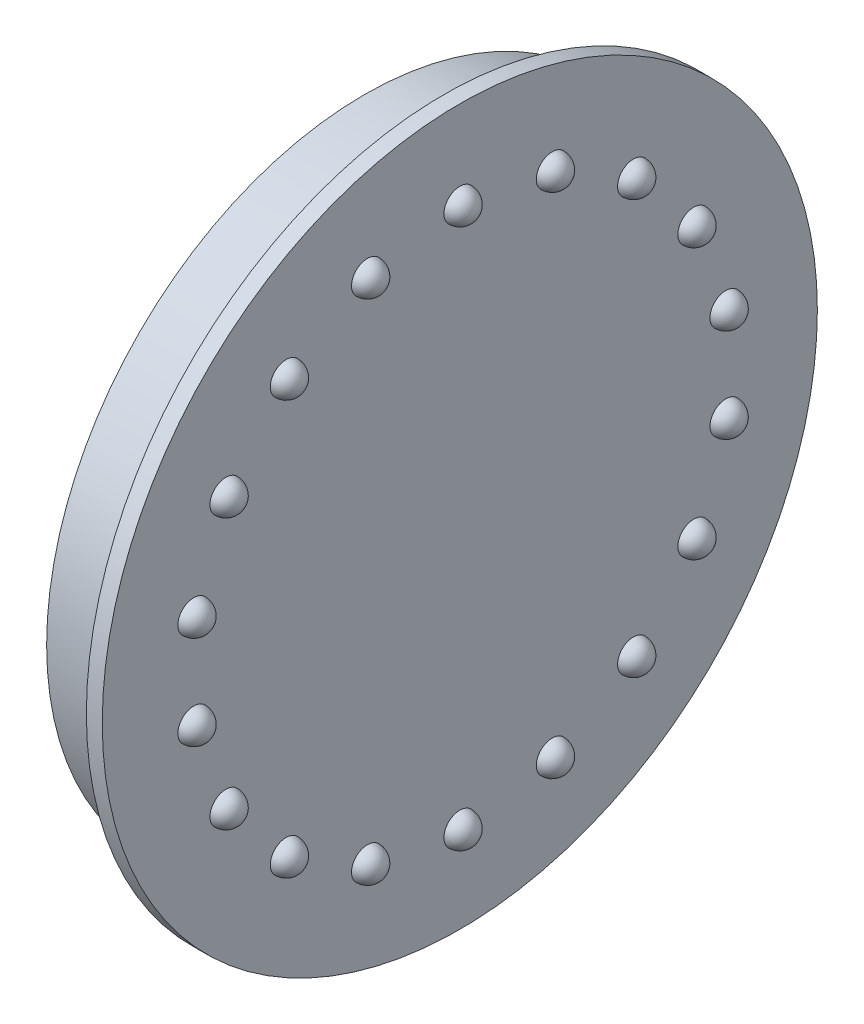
ISO-10303-21;
HEADER;
FILE_DESCRIPTION(('STEP AP214'),'2;1');
FILE_NAME('part.step','',(''),(''),'','','');
FILE_SCHEMA(('AUTOMOTIVE_DESIGN { 1 0 10303 214 1 1 1 1 }'));
ENDSEC;
DATA;
#1=APPLICATION_CONTEXT('core data for automotive mechanical design processes');
#2=APPLICATION_PROTOCOL_DEFINITION('international standard','automotive_design',2000,#1);
#3=PRODUCT_CONTEXT('',#1,'mechanical');
#4=PRODUCT('Part','Part','',(#3));
#5=PRODUCT_RELATED_PRODUCT_CATEGORY('part','',(#4));
#6=PRODUCT_DEFINITION_FORMATION('','',#4);
#7=PRODUCT_DEFINITION_CONTEXT('part definition',#1,'design');
#8=PRODUCT_DEFINITION('design','',#6,#7);
#9=PRODUCT_DEFINITION_SHAPE('','',#8);
#10=(LENGTH_UNIT() NAMED_UNIT(*) SI_UNIT(.MILLI.,.METRE.));
#11=(NAMED_UNIT(*) PLANE_ANGLE_UNIT() SI_UNIT($,.RADIAN.));
#12=(NAMED_UNIT(*) SI_UNIT($,.STERADIAN.) SOLID_ANGLE_UNIT());
#13=UNCERTAINTY_MEASURE_WITH_UNIT(LENGTH_MEASURE(1.E-05),#10,'distance_accuracy_value','');
#14=(GEOMETRIC_REPRESENTATION_CONTEXT(3) GLOBAL_UNCERTAINTY_ASSIGNED_CONTEXT((#13)) GLOBAL_UNIT_ASSIGNED_CONTEXT((#10,
#11,#12)) REPRESENTATION_CONTEXT('',''));
#15=CARTESIAN_POINT('',(0.,0.,0.));
#16=DIRECTION('',(0.,0.,1.));
#17=DIRECTION('',(1.,0.,0.));
#18=AXIS2_PLACEMENT_3D('',#15,#16,#17);
#19=CARTESIAN_POINT('',(6.,0.,0.));
#20=DIRECTION('',(1.,0.,0.));
#21=DIRECTION('',(0.,0.,-1.));
#22=AXIS2_PLACEMENT_3D('',#19,#20,#21);
#23=PLANE('',#22);
#24=CARTESIAN_POINT('',(6.,-13.0227555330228,-10.927389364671));
#25=DIRECTION('',(1.,0.,0.));
#26=DIRECTION('',(0.,0.,-1.));
#27=AXIS2_PLACEMENT_3D('',#24,#25,#26);
#28=CIRCLE('',#27,1.);
#29=CARTESIAN_POINT('',(6.,-13.0227555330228,-11.927389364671));
#30=VERTEX_POINT('',#29);
#31=EDGE_CURVE('E98',#30,#30,#28,.T.);
#32=ORIENTED_EDGE('',*,*,#31,.F.);
#33=EDGE_LOOP('',(#32));
#34=FACE_BOUND('',#33,.T.);
#35=CARTESIAN_POINT('',(6.,-2.95201902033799,-16.7417318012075));
#36=DIRECTION('',(1.,0.,0.));
#37=DIRECTION('',(0.,0.,-1.));
#38=AXIS2_PLACEMENT_3D('',#35,#36,#37);
#39=CIRCLE('',#38,1.);
#40=CARTESIAN_POINT('',(6.,-2.95201902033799,-17.7417318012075));
#41=VERTEX_POINT('',#40);
#42=EDGE_CURVE('E92',#41,#41,#39,.T.);
#43=ORIENTED_EDGE('',*,*,#42,.F.);
#44=EDGE_LOOP('',(#43));
#45=FACE_BOUND('',#44,.T.);
#46=CARTESIAN_POINT('',(6.,8.49999999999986,-14.7224318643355));
#47=DIRECTION('',(1.,0.,0.));
#48=DIRECTION('',(0.,0.,-1.));
#49=AXIS2_PLACEMENT_3D('',#46,#47,#48);
#50=CIRCLE('',#49,0.999999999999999);
#51=CARTESIAN_POINT('',(6.,8.49999999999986,-15.7224318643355));
#52=VERTEX_POINT('',#51);
#53=EDGE_CURVE('E86',#52,#52,#50,.T.);
#54=ORIENTED_EDGE('',*,*,#53,.F.);
#55=EDGE_LOOP('',(#54));
#56=FACE_BOUND('',#55,.T.);
#57=CARTESIAN_POINT('',(6.,15.9747745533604,-5.81434243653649));
#58=DIRECTION('',(1.,0.,0.));
#59=DIRECTION('',(0.,0.,-1.));
#60=AXIS2_PLACEMENT_3D('',#57,#58,#59);
#61=CIRCLE('',#60,1.);
#62=CARTESIAN_POINT('',(6.,15.9747745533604,-6.81434243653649));
#63=VERTEX_POINT('',#62);
#64=EDGE_CURVE('E80',#63,#63,#61,.T.);
#65=ORIENTED_EDGE('',*,*,#64,.F.);
#66=EDGE_LOOP('',(#65));
#67=FACE_BOUND('',#66,.T.);
#68=CARTESIAN_POINT('',(6.,15.9747745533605,5.81434243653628));
#69=DIRECTION('',(1.,0.,0.));
#70=DIRECTION('',(0.,0.,-1.));
#71=AXIS2_PLACEMENT_3D('',#68,#69,#70);
#72=CIRCLE('',#71,1.);
#73=CARTESIAN_POINT('',(6.,15.9747745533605,4.81434243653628));
#74=VERTEX_POINT('',#73);
#75=EDGE_CURVE('E74',#74,#74,#72,.T.);
#76=ORIENTED_EDGE('',*,*,#75,.F.);
#77=EDGE_LOOP('',(#76));
#78=FACE_BOUND('',#77,.T.);
#79=CARTESIAN_POINT('',(6.,8.50000000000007,14.7224318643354));
#80=DIRECTION('',(1.,0.,0.));
#81=DIRECTION('',(0.,0.,-1.));
#82=AXIS2_PLACEMENT_3D('',#79,#80,#81);
#83=CIRCLE('',#82,0.999999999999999);
#84=CARTESIAN_POINT('',(6.,8.50000000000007,13.7224318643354));
#85=VERTEX_POINT('',#84);
#86=EDGE_CURVE('E68',#85,#85,#83,.T.);
#87=ORIENTED_EDGE('',*,*,#86,.F.);
#88=EDGE_LOOP('',(#87));
#89=FACE_BOUND('',#88,.T.);
#90=CARTESIAN_POINT('',(6.,-2.95201902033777,16.7417318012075));
#91=DIRECTION('',(1.,0.,0.));
#92=DIRECTION('',(0.,0.,-1.));
#93=AXIS2_PLACEMENT_3D('',#90,#91,#92);
#94=CIRCLE('',#93,0.999999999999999);
#95=CARTESIAN_POINT('',(6.,-2.95201902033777,15.7417318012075));
#96=VERTEX_POINT('',#95);
#97=EDGE_CURVE('E62',#96,#96,#94,.T.);
#98=ORIENTED_EDGE('',*,*,#97,.F.);
#99=EDGE_LOOP('',(#98));
#100=FACE_BOUND('',#99,.T.);
#101=CARTESIAN_POINT('',(6.,-13.0227555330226,10.9273893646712));
#102=DIRECTION('',(1.,0.,0.));
#103=DIRECTION('',(0.,0.,-1.));
#104=AXIS2_PLACEMENT_3D('',#101,#102,#103);
#105=CIRCLE('',#104,0.999999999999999);
#106=CARTESIAN_POINT('',(6.,-13.0227555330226,9.92738936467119));
#107=VERTEX_POINT('',#106);
#108=EDGE_CURVE('E56',#107,#107,#105,.T.);
#109=ORIENTED_EDGE('',*,*,#108,.F.);
#110=EDGE_LOOP('',(#109));
#111=FACE_BOUND('',#110,.T.);
#112=CARTESIAN_POINT('',(6.,-17.,0.));
#113=DIRECTION('',(1.,0.,0.));
#114=DIRECTION('',(0.,0.,-1.));
#115=AXIS2_PLACEMENT_3D('',#112,#113,#114);
#116=CIRCLE('',#115,1.);
#117=CARTESIAN_POINT('',(6.,-17.,-1.));
#118=VERTEX_POINT('',#117);
#119=EDGE_CURVE('E50',#118,#118,#116,.T.);
#120=ORIENTED_EDGE('',*,*,#119,.F.);
#121=EDGE_LOOP('',(#120));
#122=FACE_BOUND('',#121,.T.);
#123=CARTESIAN_POINT('',(6.,0.,0.));
#124=DIRECTION('',(1.,0.,0.));
#125=DIRECTION('',(0.,0.,-1.));
#126=AXIS2_PLACEMENT_3D('',#123,#124,#125);
#127=CIRCLE('',#126,22.5);
#128=CARTESIAN_POINT('',(6.,0.,-22.5));
#129=VERTEX_POINT('',#128);
#130=EDGE_CURVE('E41',#129,#129,#127,.T.);
#131=ORIENTED_EDGE('',*,*,#130,.T.);
#132=EDGE_LOOP('',(#131));
#133=FACE_BOUND('',#132,.T.);
#134=CARTESIAN_POINT('',(6.,-15.9747745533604,5.81434243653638));
#135=DIRECTION('',(1.,0.,0.));
#136=DIRECTION('',(0.,0.,-1.));
#137=AXIS2_PLACEMENT_3D('',#134,#135,#136);
#138=CIRCLE('',#137,1.);
#139=CARTESIAN_POINT('',(6.,-15.9747745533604,4.81434243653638));
#140=VERTEX_POINT('',#139);
#141=EDGE_CURVE('E53',#140,#140,#138,.T.);
#142=ORIENTED_EDGE('',*,*,#141,.F.);
#143=EDGE_LOOP('',(#142));
#144=FACE_BOUND('',#143,.T.);
#145=CARTESIAN_POINT('',(6.,-8.49999999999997,14.7224318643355));
#146=DIRECTION('',(1.,0.,0.));
#147=DIRECTION('',(0.,0.,-1.));
#148=AXIS2_PLACEMENT_3D('',#145,#146,#147);
#149=CIRCLE('',#148,1.);
#150=CARTESIAN_POINT('',(6.,-8.49999999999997,13.7224318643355));
#151=VERTEX_POINT('',#150);
#152=EDGE_CURVE('E59',#151,#151,#149,.T.);
#153=ORIENTED_EDGE('',*,*,#152,.F.);
#154=EDGE_LOOP('',(#153));
#155=FACE_BOUND('',#154,.T.);
#156=CARTESIAN_POINT('',(6.,2.95201902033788,16.7417318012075));
#157=DIRECTION('',(1.,0.,0.));
#158=DIRECTION('',(0.,0.,-1.));
#159=AXIS2_PLACEMENT_3D('',#156,#157,#158);
#160=CIRCLE('',#159,1.);
#161=CARTESIAN_POINT('',(6.,2.95201902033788,15.7417318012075));
#162=VERTEX_POINT('',#161);
#163=EDGE_CURVE('E65',#162,#162,#160,.T.);
#164=ORIENTED_EDGE('',*,*,#163,.F.);
#165=EDGE_LOOP('',(#164));
#166=FACE_BOUND('',#165,.T.);
#167=CARTESIAN_POINT('',(6.,13.0227555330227,10.9273893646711));
#168=DIRECTION('',(1.,0.,0.));
#169=DIRECTION('',(0.,0.,-1.));
#170=AXIS2_PLACEMENT_3D('',#167,#168,#169);
#171=CIRCLE('',#170,1.);
#172=CARTESIAN_POINT('',(6.,13.0227555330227,9.9273893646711));
#173=VERTEX_POINT('',#172);
#174=EDGE_CURVE('E71',#173,#173,#171,.T.);
#175=ORIENTED_EDGE('',*,*,#174,.F.);
#176=EDGE_LOOP('',(#175));
#177=FACE_BOUND('',#176,.T.);
#178=CARTESIAN_POINT('',(6.,17.,-1.18710434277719E-13));
#179=DIRECTION('',(1.,0.,0.));
#180=DIRECTION('',(0.,0.,-1.));
#181=AXIS2_PLACEMENT_3D('',#178,#179,#180);
#182=CIRCLE('',#181,1.);
#183=CARTESIAN_POINT('',(6.,17.,-1.00000000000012));
#184=VERTEX_POINT('',#183);
#185=EDGE_CURVE('E77',#184,#184,#182,.T.);
#186=ORIENTED_EDGE('',*,*,#185,.F.);
#187=EDGE_LOOP('',(#186));
#188=FACE_BOUND('',#187,.T.);
#189=CARTESIAN_POINT('',(6.,13.0227555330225,-10.9273893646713));
#190=DIRECTION('',(1.,0.,0.));
#191=DIRECTION('',(0.,0.,-1.));
#192=AXIS2_PLACEMENT_3D('',#189,#190,#191);
#193=CIRCLE('',#192,1.);
#194=CARTESIAN_POINT('',(6.,13.0227555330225,-11.9273893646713));
#195=VERTEX_POINT('',#194);
#196=EDGE_CURVE('E83',#195,#195,#193,.T.);
#197=ORIENTED_EDGE('',*,*,#196,.F.);
#198=EDGE_LOOP('',(#197));
#199=FACE_BOUND('',#198,.T.);
#200=CARTESIAN_POINT('',(6.,2.95201902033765,-16.7417318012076));
#201=DIRECTION('',(1.,0.,0.));
#202=DIRECTION('',(0.,0.,-1.));
#203=AXIS2_PLACEMENT_3D('',#200,#201,#202);
#204=CIRCLE('',#203,1.);
#205=CARTESIAN_POINT('',(6.,2.95201902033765,-17.7417318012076));
#206=VERTEX_POINT('',#205);
#207=EDGE_CURVE('E89',#206,#206,#204,.T.);
#208=ORIENTED_EDGE('',*,*,#207,.F.);
#209=EDGE_LOOP('',(#208));
#210=FACE_BOUND('',#209,.T.);
#211=CARTESIAN_POINT('',(6.,-8.50000000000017,-14.7224318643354));
#212=DIRECTION('',(1.,0.,0.));
#213=DIRECTION('',(0.,0.,-1.));
#214=AXIS2_PLACEMENT_3D('',#211,#212,#213);
#215=CIRCLE('',#214,1.);
#216=CARTESIAN_POINT('',(6.,-8.50000000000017,-15.7224318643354));
#217=VERTEX_POINT('',#216);
#218=EDGE_CURVE('E95',#217,#217,#215,.T.);
#219=ORIENTED_EDGE('',*,*,#218,.F.);
#220=EDGE_LOOP('',(#219));
#221=FACE_BOUND('',#220,.T.);
#222=CARTESIAN_POINT('',(6.,-15.9747745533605,-5.81434243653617));
#223=DIRECTION('',(1.,0.,0.));
#224=DIRECTION('',(0.,0.,-1.));
#225=AXIS2_PLACEMENT_3D('',#222,#223,#224);
#226=CIRCLE('',#225,1.);
#227=CARTESIAN_POINT('',(6.,-15.9747745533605,-6.81434243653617));
#228=VERTEX_POINT('',#227);
#229=EDGE_CURVE('E101',#228,#228,#226,.T.);
#230=ORIENTED_EDGE('',*,*,#229,.F.);
#231=EDGE_LOOP('',(#230));
#232=FACE_BOUND('',#231,.T.);
#233=ADVANCED_FACE('F30',(#34,#45,#56,#67,#78,#89,#100,#111,#122,#133,#144,#155,#166,#177,#188,
#199,#210,#221,#232),#23,.T.);
#234=CARTESIAN_POINT('',(5.,0.,0.));
#235=DIRECTION('',(-1.,0.,0.));
#236=DIRECTION('',(0.,0.,1.));
#237=AXIS2_PLACEMENT_3D('',#234,#235,#236);
#238=CYLINDRICAL_SURFACE('',#237,20.);
#239=CARTESIAN_POINT('',(5.,0.,0.));
#240=DIRECTION('',(1.,0.,0.));
#241=DIRECTION('',(0.,0.,-1.));
#242=AXIS2_PLACEMENT_3D('',#239,#240,#241);
#243=CIRCLE('',#242,20.);
#244=CARTESIAN_POINT('',(5.,0.,-20.));
#245=VERTEX_POINT('',#244);
#246=EDGE_CURVE('E10',#245,#245,#243,.T.);
#247=ORIENTED_EDGE('',*,*,#246,.F.);
#248=EDGE_LOOP('',(#247));
#249=FACE_BOUND('',#248,.T.);
#250=CARTESIAN_POINT('',(0.,0.,0.));
#251=DIRECTION('',(1.,0.,0.));
#252=DIRECTION('',(0.,0.,-1.));
#253=AXIS2_PLACEMENT_3D('',#250,#251,#252);
#254=CIRCLE('',#253,20.);
#255=CARTESIAN_POINT('',(0.,0.,-20.));
#256=VERTEX_POINT('',#255);
#257=EDGE_CURVE('E37',#256,#256,#254,.T.);
#258=ORIENTED_EDGE('',*,*,#257,.T.);
#259=EDGE_LOOP('',(#258));
#260=FACE_BOUND('',#259,.T.);
#261=ADVANCED_FACE('F32',(#249,#260),#238,.T.);
#262=CARTESIAN_POINT('',(0.,0.,0.));
#263=DIRECTION('',(1.,0.,0.));
#264=DIRECTION('',(0.,0.,-1.));
#265=AXIS2_PLACEMENT_3D('',#262,#263,#264);
#266=PLANE('',#265);
#267=ORIENTED_EDGE('',*,*,#257,.F.);
#268=EDGE_LOOP('',(#267));
#269=FACE_BOUND('',#268,.T.);
#270=ADVANCED_FACE('F113',(#269),#266,.F.);
#271=CARTESIAN_POINT('',(5.,0.,0.));
#272=DIRECTION('',(1.,0.,0.));
#273=DIRECTION('',(0.,0.,-1.));
#274=AXIS2_PLACEMENT_3D('',#271,#272,#273);
#275=PLANE('',#274);
#276=CARTESIAN_POINT('',(5.,0.,0.));
#277=DIRECTION('',(1.,0.,0.));
#278=DIRECTION('',(0.,0.,-1.));
#279=AXIS2_PLACEMENT_3D('',#276,#277,#278);
#280=CIRCLE('',#279,22.5);
#281=CARTESIAN_POINT('',(5.,0.,-22.5));
#282=VERTEX_POINT('',#281);
#283=EDGE_CURVE('E45',#282,#282,#280,.T.);
#284=ORIENTED_EDGE('',*,*,#283,.F.);
#285=EDGE_LOOP('',(#284));
#286=FACE_BOUND('',#285,.T.);
#287=ORIENTED_EDGE('',*,*,#246,.T.);
#288=EDGE_LOOP('',(#287));
#289=FACE_BOUND('',#288,.T.);
#290=ADVANCED_FACE('F119',(#286,#289),#275,.F.);
#291=CARTESIAN_POINT('',(6.,0.,0.));
#292=DIRECTION('',(-1.,0.,0.));
#293=DIRECTION('',(0.,0.,1.));
#294=AXIS2_PLACEMENT_3D('',#291,#292,#293);
#295=CYLINDRICAL_SURFACE('',#294,22.5);
#296=ORIENTED_EDGE('',*,*,#130,.F.);
#297=EDGE_LOOP('',(#296));
#298=FACE_BOUND('',#297,.T.);
#299=ORIENTED_EDGE('',*,*,#283,.T.);
#300=EDGE_LOOP('',(#299));
#301=FACE_BOUND('',#300,.T.);
#302=ADVANCED_FACE('F121',(#298,#301),#295,.T.);
#303=CARTESIAN_POINT('',(6.,15.9747745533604,-5.81434243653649));
#304=DIRECTION('',(0.,0.,1.));
#305=DIRECTION('',(1.,0.,0.));
#306=AXIS2_PLACEMENT_3D('',#303,#304,#305);
#307=SPHERICAL_SURFACE('',#306,1.);
#308=CARTESIAN_POINT('',(6.,15.9747745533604,-5.81434243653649));
#309=DIRECTION('',(1.,0.,0.));
#310=DIRECTION('',(0.,0.,-1.));
#311=AXIS2_PLACEMENT_3D('',#308,#309,#310);
#312=SPHERICAL_SURFACE('',#311,1.);
#313=ORIENTED_EDGE('',*,*,#64,.T.);
#314=EDGE_LOOP('',(#313));
#315=FACE_BOUND('',#314,.T.);
#316=ADVANCED_FACE('F123',(#315),#312,.T.);
#317=CARTESIAN_POINT('',(6.,13.0227555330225,-10.9273893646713));
#318=DIRECTION('',(0.,0.,1.));
#319=DIRECTION('',(1.,0.,0.));
#320=AXIS2_PLACEMENT_3D('',#317,#318,#319);
#321=SPHERICAL_SURFACE('',#320,1.);
#322=CARTESIAN_POINT('',(6.,13.0227555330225,-10.9273893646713));
#323=DIRECTION('',(1.,0.,0.));
#324=DIRECTION('',(0.,0.,-1.));
#325=AXIS2_PLACEMENT_3D('',#322,#323,#324);
#326=SPHERICAL_SURFACE('',#325,1.);
#327=ORIENTED_EDGE('',*,*,#196,.T.);
#328=EDGE_LOOP('',(#327));
#329=FACE_BOUND('',#328,.T.);
#330=ADVANCED_FACE('F145',(#329),#326,.T.);
#331=CARTESIAN_POINT('',(6.,8.49999999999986,-14.7224318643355));
#332=DIRECTION('',(0.,0.,1.));
#333=DIRECTION('',(1.,0.,0.));
#334=AXIS2_PLACEMENT_3D('',#331,#332,#333);
#335=SPHERICAL_SURFACE('',#334,1.);
#336=CARTESIAN_POINT('',(6.,8.49999999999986,-14.7224318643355));
#337=DIRECTION('',(1.,0.,0.));
#338=DIRECTION('',(0.,0.,-1.));
#339=AXIS2_PLACEMENT_3D('',#336,#337,#338);
#340=SPHERICAL_SURFACE('',#339,1.);
#341=ORIENTED_EDGE('',*,*,#53,.T.);
#342=EDGE_LOOP('',(#341));
#343=FACE_BOUND('',#342,.T.);
#344=ADVANCED_FACE('F151',(#343),#340,.T.);
#345=CARTESIAN_POINT('',(6.,2.95201902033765,-16.7417318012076));
#346=DIRECTION('',(0.,0.,1.));
#347=DIRECTION('',(1.,0.,0.));
#348=AXIS2_PLACEMENT_3D('',#345,#346,#347);
#349=SPHERICAL_SURFACE('',#348,1.);
#350=CARTESIAN_POINT('',(6.,2.95201902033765,-16.7417318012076));
#351=DIRECTION('',(1.,0.,0.));
#352=DIRECTION('',(0.,0.,-1.));
#353=AXIS2_PLACEMENT_3D('',#350,#351,#352);
#354=SPHERICAL_SURFACE('',#353,1.);
#355=ORIENTED_EDGE('',*,*,#207,.T.);
#356=EDGE_LOOP('',(#355));
#357=FACE_BOUND('',#356,.T.);
#358=ADVANCED_FACE('F158',(#357),#354,.T.);
#359=CARTESIAN_POINT('',(6.,-2.95201902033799,-16.7417318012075));
#360=DIRECTION('',(0.,0.,1.));
#361=DIRECTION('',(1.,0.,0.));
#362=AXIS2_PLACEMENT_3D('',#359,#360,#361);
#363=SPHERICAL_SURFACE('',#362,1.);
#364=CARTESIAN_POINT('',(6.,-2.95201902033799,-16.7417318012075));
#365=DIRECTION('',(1.,0.,0.));
#366=DIRECTION('',(0.,0.,-1.));
#367=AXIS2_PLACEMENT_3D('',#364,#365,#366);
#368=SPHERICAL_SURFACE('',#367,1.);
#369=ORIENTED_EDGE('',*,*,#42,.T.);
#370=EDGE_LOOP('',(#369));
#371=FACE_BOUND('',#370,.T.);
#372=ADVANCED_FACE('F165',(#371),#368,.T.);
#373=CARTESIAN_POINT('',(6.,-8.50000000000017,-14.7224318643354));
#374=DIRECTION('',(0.,0.,1.));
#375=DIRECTION('',(1.,0.,0.));
#376=AXIS2_PLACEMENT_3D('',#373,#374,#375);
#377=SPHERICAL_SURFACE('',#376,1.);
#378=CARTESIAN_POINT('',(6.,-8.50000000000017,-14.7224318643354));
#379=DIRECTION('',(1.,0.,0.));
#380=DIRECTION('',(0.,0.,-1.));
#381=AXIS2_PLACEMENT_3D('',#378,#379,#380);
#382=SPHERICAL_SURFACE('',#381,1.);
#383=ORIENTED_EDGE('',*,*,#218,.T.);
#384=EDGE_LOOP('',(#383));
#385=FACE_BOUND('',#384,.T.);
#386=ADVANCED_FACE('F172',(#385),#382,.T.);
#387=CARTESIAN_POINT('',(6.,-13.0227555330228,-10.927389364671));
#388=DIRECTION('',(0.,0.,1.));
#389=DIRECTION('',(1.,0.,0.));
#390=AXIS2_PLACEMENT_3D('',#387,#388,#389);
#391=SPHERICAL_SURFACE('',#390,1.);
#392=CARTESIAN_POINT('',(6.,-13.0227555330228,-10.927389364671));
#393=DIRECTION('',(1.,0.,0.));
#394=DIRECTION('',(0.,0.,-1.));
#395=AXIS2_PLACEMENT_3D('',#392,#393,#394);
#396=SPHERICAL_SURFACE('',#395,1.);
#397=ORIENTED_EDGE('',*,*,#31,.T.);
#398=EDGE_LOOP('',(#397));
#399=FACE_BOUND('',#398,.T.);
#400=ADVANCED_FACE('F179',(#399),#396,.T.);
#401=CARTESIAN_POINT('',(6.,-15.9747745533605,-5.81434243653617));
#402=DIRECTION('',(0.,0.,1.));
#403=DIRECTION('',(1.,0.,0.));
#404=AXIS2_PLACEMENT_3D('',#401,#402,#403);
#405=SPHERICAL_SURFACE('',#404,1.);
#406=CARTESIAN_POINT('',(6.,-15.9747745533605,-5.81434243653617));
#407=DIRECTION('',(1.,0.,0.));
#408=DIRECTION('',(0.,0.,-1.));
#409=AXIS2_PLACEMENT_3D('',#406,#407,#408);
#410=SPHERICAL_SURFACE('',#409,1.);
#411=ORIENTED_EDGE('',*,*,#229,.T.);
#412=EDGE_LOOP('',(#411));
#413=FACE_BOUND('',#412,.T.);
#414=ADVANCED_FACE('F105',(#413),#410,.T.);
#415=CARTESIAN_POINT('',(6.,-17.,0.));
#416=DIRECTION('',(0.,0.,1.));
#417=DIRECTION('',(1.,0.,0.));
#418=AXIS2_PLACEMENT_3D('',#415,#416,#417);
#419=SPHERICAL_SURFACE('',#418,1.);
#420=CARTESIAN_POINT('',(6.,-17.,0.));
#421=DIRECTION('',(1.,0.,0.));
#422=DIRECTION('',(0.,0.,-1.));
#423=AXIS2_PLACEMENT_3D('',#420,#421,#422);
#424=SPHERICAL_SURFACE('',#423,1.);
#425=ORIENTED_EDGE('',*,*,#119,.T.);
#426=EDGE_LOOP('',(#425));
#427=FACE_BOUND('',#426,.T.);
#428=ADVANCED_FACE('F192',(#427),#424,.T.);
#429=CARTESIAN_POINT('',(6.,-15.9747745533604,5.81434243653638));
#430=DIRECTION('',(0.,0.,1.));
#431=DIRECTION('',(1.,0.,0.));
#432=AXIS2_PLACEMENT_3D('',#429,#430,#431);
#433=SPHERICAL_SURFACE('',#432,1.);
#434=CARTESIAN_POINT('',(6.,-15.9747745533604,5.81434243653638));
#435=DIRECTION('',(1.,0.,0.));
#436=DIRECTION('',(0.,0.,-1.));
#437=AXIS2_PLACEMENT_3D('',#434,#435,#436);
#438=SPHERICAL_SURFACE('',#437,1.);
#439=ORIENTED_EDGE('',*,*,#141,.T.);
#440=EDGE_LOOP('',(#439));
#441=FACE_BOUND('',#440,.T.);
#442=ADVANCED_FACE('F198',(#441),#438,.T.);
#443=CARTESIAN_POINT('',(6.,-13.0227555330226,10.9273893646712));
#444=DIRECTION('',(0.,0.,1.));
#445=DIRECTION('',(1.,0.,0.));
#446=AXIS2_PLACEMENT_3D('',#443,#444,#445);
#447=SPHERICAL_SURFACE('',#446,1.);
#448=CARTESIAN_POINT('',(6.,-13.0227555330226,10.9273893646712));
#449=DIRECTION('',(1.,0.,0.));
#450=DIRECTION('',(0.,0.,-1.));
#451=AXIS2_PLACEMENT_3D('',#448,#449,#450);
#452=SPHERICAL_SURFACE('',#451,1.);
#453=ORIENTED_EDGE('',*,*,#108,.T.);
#454=EDGE_LOOP('',(#453));
#455=FACE_BOUND('',#454,.T.);
#456=ADVANCED_FACE('F205',(#455),#452,.T.);
#457=CARTESIAN_POINT('',(6.,-8.49999999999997,14.7224318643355));
#458=DIRECTION('',(0.,0.,1.));
#459=DIRECTION('',(1.,0.,0.));
#460=AXIS2_PLACEMENT_3D('',#457,#458,#459);
#461=SPHERICAL_SURFACE('',#460,1.);
#462=CARTESIAN_POINT('',(6.,-8.49999999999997,14.7224318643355));
#463=DIRECTION('',(1.,0.,0.));
#464=DIRECTION('',(0.,0.,-1.));
#465=AXIS2_PLACEMENT_3D('',#462,#463,#464);
#466=SPHERICAL_SURFACE('',#465,1.);
#467=ORIENTED_EDGE('',*,*,#152,.T.);
#468=EDGE_LOOP('',(#467));
#469=FACE_BOUND('',#468,.T.);
#470=ADVANCED_FACE('F212',(#469),#466,.T.);
#471=CARTESIAN_POINT('',(6.,-2.95201902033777,16.7417318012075));
#472=DIRECTION('',(0.,0.,1.));
#473=DIRECTION('',(1.,0.,0.));
#474=AXIS2_PLACEMENT_3D('',#471,#472,#473);
#475=SPHERICAL_SURFACE('',#474,1.);
#476=CARTESIAN_POINT('',(6.,-2.95201902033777,16.7417318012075));
#477=DIRECTION('',(1.,0.,0.));
#478=DIRECTION('',(0.,0.,-1.));
#479=AXIS2_PLACEMENT_3D('',#476,#477,#478);
#480=SPHERICAL_SURFACE('',#479,1.);
#481=ORIENTED_EDGE('',*,*,#97,.T.);
#482=EDGE_LOOP('',(#481));
#483=FACE_BOUND('',#482,.T.);
#484=ADVANCED_FACE('F219',(#483),#480,.T.);
#485=CARTESIAN_POINT('',(6.,2.95201902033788,16.7417318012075));
#486=DIRECTION('',(0.,0.,1.));
#487=DIRECTION('',(1.,0.,0.));
#488=AXIS2_PLACEMENT_3D('',#485,#486,#487);
#489=SPHERICAL_SURFACE('',#488,1.);
#490=CARTESIAN_POINT('',(6.,2.95201902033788,16.7417318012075));
#491=DIRECTION('',(1.,0.,0.));
#492=DIRECTION('',(0.,0.,-1.));
#493=AXIS2_PLACEMENT_3D('',#490,#491,#492);
#494=SPHERICAL_SURFACE('',#493,1.);
#495=ORIENTED_EDGE('',*,*,#163,.T.);
#496=EDGE_LOOP('',(#495));
#497=FACE_BOUND('',#496,.T.);
#498=ADVANCED_FACE('F226',(#497),#494,.T.);
#499=CARTESIAN_POINT('',(6.,8.50000000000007,14.7224318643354));
#500=DIRECTION('',(0.,0.,1.));
#501=DIRECTION('',(1.,0.,0.));
#502=AXIS2_PLACEMENT_3D('',#499,#500,#501);
#503=SPHERICAL_SURFACE('',#502,1.);
#504=CARTESIAN_POINT('',(6.,8.50000000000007,14.7224318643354));
#505=DIRECTION('',(1.,0.,0.));
#506=DIRECTION('',(0.,0.,-1.));
#507=AXIS2_PLACEMENT_3D('',#504,#505,#506);
#508=SPHERICAL_SURFACE('',#507,1.);
#509=ORIENTED_EDGE('',*,*,#86,.T.);
#510=EDGE_LOOP('',(#509));
#511=FACE_BOUND('',#510,.T.);
#512=ADVANCED_FACE('F233',(#511),#508,.T.);
#513=CARTESIAN_POINT('',(6.,13.0227555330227,10.9273893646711));
#514=DIRECTION('',(0.,0.,1.));
#515=DIRECTION('',(1.,0.,0.));
#516=AXIS2_PLACEMENT_3D('',#513,#514,#515);
#517=SPHERICAL_SURFACE('',#516,1.);
#518=CARTESIAN_POINT('',(6.,13.0227555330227,10.9273893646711));
#519=DIRECTION('',(1.,0.,0.));
#520=DIRECTION('',(0.,0.,-1.));
#521=AXIS2_PLACEMENT_3D('',#518,#519,#520);
#522=SPHERICAL_SURFACE('',#521,1.);
#523=ORIENTED_EDGE('',*,*,#174,.T.);
#524=EDGE_LOOP('',(#523));
#525=FACE_BOUND('',#524,.T.);
#526=ADVANCED_FACE('F240',(#525),#522,.T.);
#527=CARTESIAN_POINT('',(6.,15.9747745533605,5.81434243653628));
#528=DIRECTION('',(0.,0.,1.));
#529=DIRECTION('',(1.,0.,0.));
#530=AXIS2_PLACEMENT_3D('',#527,#528,#529);
#531=SPHERICAL_SURFACE('',#530,1.);
#532=CARTESIAN_POINT('',(6.,15.9747745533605,5.81434243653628));
#533=DIRECTION('',(1.,0.,0.));
#534=DIRECTION('',(0.,0.,-1.));
#535=AXIS2_PLACEMENT_3D('',#532,#533,#534);
#536=SPHERICAL_SURFACE('',#535,1.);
#537=ORIENTED_EDGE('',*,*,#75,.T.);
#538=EDGE_LOOP('',(#537));
#539=FACE_BOUND('',#538,.T.);
#540=ADVANCED_FACE('F247',(#539),#536,.T.);
#541=CARTESIAN_POINT('',(6.,17.,-1.18710434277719E-13));
#542=DIRECTION('',(0.,0.,1.));
#543=DIRECTION('',(1.,0.,0.));
#544=AXIS2_PLACEMENT_3D('',#541,#542,#543);
#545=SPHERICAL_SURFACE('',#544,1.);
#546=CARTESIAN_POINT('',(6.,17.,-1.18710434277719E-13));
#547=DIRECTION('',(1.,0.,0.));
#548=DIRECTION('',(0.,0.,-1.));
#549=AXIS2_PLACEMENT_3D('',#546,#547,#548);
#550=SPHERICAL_SURFACE('',#549,1.);
#551=ORIENTED_EDGE('',*,*,#185,.T.);
#552=EDGE_LOOP('',(#551));
#553=FACE_BOUND('',#552,.T.);
#554=ADVANCED_FACE('F254',(#553),#550,.T.);
#555=CLOSED_SHELL('',(#233,#261,#270,#290,#302,#316,#330,#344,#358,#372,#386,#400,#414,#428,
#442,#456,#470,#484,#498,#512,#526,#540,#554));
#556=MANIFOLD_SOLID_BREP('B2',#555);
#557=ADVANCED_BREP_SHAPE_REPRESENTATION('',(#18,#556),#14);
#558=SHAPE_DEFINITION_REPRESENTATION(#9,#557);
ENDSEC;
END-ISO-10303-21;
